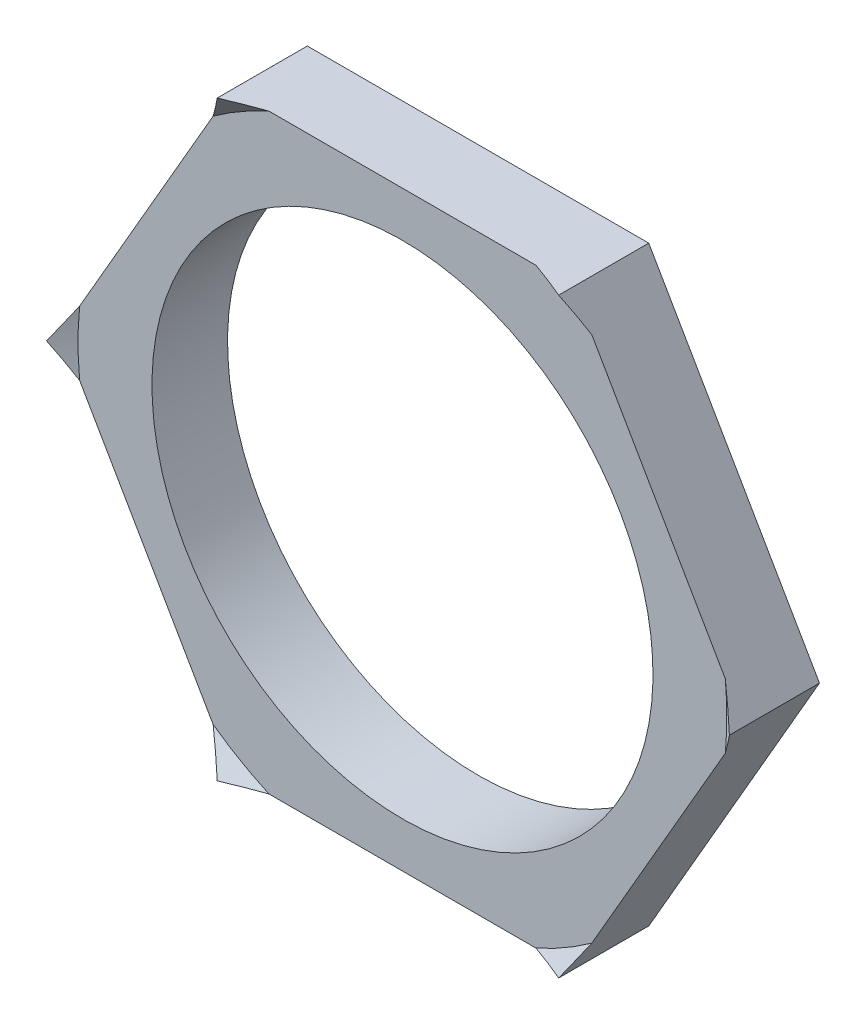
ISO-10303-21;
HEADER;
FILE_DESCRIPTION(('STEP AP214'),'2;1');
FILE_NAME('part.step','',(''),(''),'','','');
FILE_SCHEMA(('AUTOMOTIVE_DESIGN { 1 0 10303 214 1 1 1 1 }'));
ENDSEC;
DATA;
#1=APPLICATION_CONTEXT('core data for automotive mechanical design processes');
#2=APPLICATION_PROTOCOL_DEFINITION('international standard','automotive_design',2000,#1);
#3=PRODUCT_CONTEXT('',#1,'mechanical');
#4=PRODUCT('Part','Part','',(#3));
#5=PRODUCT_RELATED_PRODUCT_CATEGORY('part','',(#4));
#6=PRODUCT_DEFINITION_FORMATION('','',#4);
#7=PRODUCT_DEFINITION_CONTEXT('part definition',#1,'design');
#8=PRODUCT_DEFINITION('design','',#6,#7);
#9=PRODUCT_DEFINITION_SHAPE('','',#8);
#10=(LENGTH_UNIT() NAMED_UNIT(*) SI_UNIT(.MILLI.,.METRE.));
#11=(NAMED_UNIT(*) PLANE_ANGLE_UNIT() SI_UNIT($,.RADIAN.));
#12=(NAMED_UNIT(*) SI_UNIT($,.STERADIAN.) SOLID_ANGLE_UNIT());
#13=UNCERTAINTY_MEASURE_WITH_UNIT(LENGTH_MEASURE(1.E-05),#10,'distance_accuracy_value','');
#14=(GEOMETRIC_REPRESENTATION_CONTEXT(3) GLOBAL_UNCERTAINTY_ASSIGNED_CONTEXT((#13)) GLOBAL_UNIT_ASSIGNED_CONTEXT((#10,
#11,#12)) REPRESENTATION_CONTEXT('',''));
#15=CARTESIAN_POINT('',(0.,0.,0.));
#16=DIRECTION('',(0.,0.,1.));
#17=DIRECTION('',(1.,0.,0.));
#18=AXIS2_PLACEMENT_3D('',#15,#16,#17);
#19=CARTESIAN_POINT('',(0.,0.,-2.5));
#20=DIRECTION('',(0.,0.,1.));
#21=DIRECTION('',(0.5,0.866025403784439,0.));
#22=AXIS2_PLACEMENT_3D('',#19,#20,#21);
#23=CONICAL_SURFACE('',#22,19.75,0.863937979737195);
#24=CARTESIAN_POINT('',(0.,0.,-2.5));
#25=DIRECTION('',(0.,0.,1.));
#26=DIRECTION('',(0.5,0.866025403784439,0.));
#27=AXIS2_PLACEMENT_3D('',#24,#25,#26);
#28=CIRCLE('',#27,19.75);
#29=CARTESIAN_POINT('',(11.5245152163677,16.0389541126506,-2.5));
#30=VERTEX_POINT('',#29);
#31=CARTESIAN_POINT('',(8.12788410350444,18.,-2.5));
#32=VERTEX_POINT('',#31);
#33=EDGE_CURVE('E43',#30,#32,#28,.T.);
#34=ORIENTED_EDGE('',*,*,#33,.F.);
#35=CARTESIAN_POINT('',(11.5245152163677,16.0389541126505,-2.49999999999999));
#36=CARTESIAN_POINT('',(11.47782751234,16.1198194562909,-2.46717979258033));
#37=CARTESIAN_POINT('',(11.4312128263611,16.2005572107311,-2.43394201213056));
#38=CARTESIAN_POINT('',(11.3378416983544,16.3622773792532,-2.36644724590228));
#39=CARTESIAN_POINT('',(11.291086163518,16.4432582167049,-2.33218522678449));
#40=CARTESIAN_POINT('',(11.1974236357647,16.6054827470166,-2.26264213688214));
#41=CARTESIAN_POINT('',(11.1505175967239,16.6867247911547,-2.22735593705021));
#42=CARTESIAN_POINT('',(11.0565442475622,16.8494893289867,-2.15576456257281));
#43=CARTESIAN_POINT('',(11.0094779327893,16.931010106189,-2.11945417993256));
#44=CARTESIAN_POINT('',(10.9151743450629,17.0943490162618,-2.04581451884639));
#45=CARTESIAN_POINT('',(10.8679381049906,17.1761653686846,-2.00847996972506));
#46=CARTESIAN_POINT('',(10.7732850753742,17.340111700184,-1.93279202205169));
#47=CARTESIAN_POINT('',(10.7258693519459,17.4222398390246,-1.89443330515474));
#48=CARTESIAN_POINT('',(10.6308479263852,17.5868253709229,-1.81669710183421));
#49=CARTESIAN_POINT('',(10.5832433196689,17.6692808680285,-1.77731426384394));
#50=CARTESIAN_POINT('',(10.4878348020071,17.834536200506,-1.69752970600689));
#51=CARTESIAN_POINT('',(10.4400320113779,17.9173340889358,-1.65712261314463));
#52=CARTESIAN_POINT('',(10.3923048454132,18.0000000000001,-1.61635984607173));
#53=B_SPLINE_CURVE_WITH_KNOTS('',3,(#35,#36,#37,#38,#39,#40,#41,#42,#43,#44,#45,#46,#47,#48,#49,
#50,#51,#52),.UNSPECIFIED.,.F.,.F.,(4,2,2,2,2,2,2,2,4),(0.,0.296924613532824,0.595686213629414,
0.896365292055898,1.19903965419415,1.50378444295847,1.81067216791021,2.11977273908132,
2.43115350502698),.UNSPECIFIED.);
#54=CARTESIAN_POINT('',(10.3923048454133,18.,-1.61635984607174));
#55=VERTEX_POINT('',#54);
#56=EDGE_CURVE('E11',#30,#55,#53,.T.);
#57=ORIENTED_EDGE('',*,*,#56,.T.);
#58=CARTESIAN_POINT('',(10.3923048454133,18.,-1.61635984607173));
#59=CARTESIAN_POINT('',(10.2968504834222,17.999999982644,-1.65712261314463));
#60=CARTESIAN_POINT('',(10.2012440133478,17.9999994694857,-1.69752970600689));
#61=CARTESIAN_POINT('',(10.0104244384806,17.9999980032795,-1.77731426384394));
#62=CARTESIAN_POINT('',(9.91521357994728,17.9999970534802,-1.8166971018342));
#63=CARTESIAN_POINT('',(9.72516761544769,17.9999952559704,-1.89443330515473));
#64=CARTESIAN_POINT('',(9.63033469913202,17.9999944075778,-1.93279202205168));
#65=CARTESIAN_POINT('',(9.44102649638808,17.999993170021,-2.00847996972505));
#66=CARTESIAN_POINT('',(9.34655333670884,17.9999927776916,-2.04581451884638));
#67=CARTESIAN_POINT('',(9.15794589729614,17.9999926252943,-2.11945417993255));
#68=CARTESIAN_POINT('',(9.06381367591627,17.9999928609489,-2.1557645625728));
#69=CARTESIAN_POINT('',(8.87586877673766,17.9999938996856,-2.2273559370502));
#70=CARTESIAN_POINT('',(8.78205808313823,17.9999946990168,-2.26264213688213));
#71=CARTESIAN_POINT('',(8.59473625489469,17.999996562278,-2.33218522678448));
#72=CARTESIAN_POINT('',(8.50122702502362,17.999997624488,-2.36644724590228));
#73=CARTESIAN_POINT('',(8.3144876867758,17.9999993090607,-2.43394201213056));
#74=CARTESIAN_POINT('',(8.2212593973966,17.9999999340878,-2.46717979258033));
#75=CARTESIAN_POINT('',(8.12788410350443,18.,-2.49999999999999));
#76=B_SPLINE_CURVE_WITH_KNOTS('',3,(#58,#59,#60,#61,#62,#63,#64,#65,#66,#67,#68,#69,#70,#71,#72,
#73,#74,#75),.UNSPECIFIED.,.F.,.F.,(4,2,2,2,2,2,2,2,4),(0.,0.311380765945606,0.620481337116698,
0.927369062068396,1.2321138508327,1.53478821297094,1.83546729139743,2.13422889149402,
2.43115350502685),.UNSPECIFIED.);
#77=EDGE_CURVE('E30',#55,#32,#76,.T.);
#78=ORIENTED_EDGE('',*,*,#77,.T.);
#79=EDGE_LOOP('',(#34,#57,#78));
#80=FACE_BOUND('',#79,.T.);
#81=ADVANCED_FACE('F16',(#80),#23,.F.);
#82=CARTESIAN_POINT('',(0.,0.,-1.6));
#83=DIRECTION('',(0.,0.,-1.));
#84=DIRECTION('',(-0.5,-0.866025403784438,0.));
#85=AXIS2_PLACEMENT_3D('',#82,#83,#84);
#86=CYLINDRICAL_SURFACE('',#85,15.25);
#87=CARTESIAN_POINT('',(0.,0.,-2.5));
#88=DIRECTION('',(0.,0.,1.));
#89=DIRECTION('',(0.5,0.866025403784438,0.));
#90=AXIS2_PLACEMENT_3D('',#87,#88,#89);
#91=CIRCLE('',#90,15.25);
#92=CARTESIAN_POINT('',(7.625,13.2068874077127,-2.5));
#93=VERTEX_POINT('',#92);
#94=EDGE_CURVE('E372',#93,#93,#91,.T.);
#95=ORIENTED_EDGE('',*,*,#94,.T.);
#96=EDGE_LOOP('',(#95));
#97=FACE_BOUND('',#96,.T.);
#98=CARTESIAN_POINT('',(0.,0.,-7.1));
#99=DIRECTION('',(0.,0.,1.));
#100=DIRECTION('',(0.5,0.866025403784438,0.));
#101=AXIS2_PLACEMENT_3D('',#98,#99,#100);
#102=CIRCLE('',#101,15.25);
#103=CARTESIAN_POINT('',(-7.625,-13.2068874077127,-7.1));
#104=VERTEX_POINT('',#103);
#105=EDGE_CURVE('E807',#104,#104,#102,.T.);
#106=ORIENTED_EDGE('',*,*,#105,.F.);
#107=EDGE_LOOP('',(#106));
#108=FACE_BOUND('',#107,.T.);
#109=ADVANCED_FACE('F482',(#97,#108),#86,.F.);
#110=CARTESIAN_POINT('',(-10.3923048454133,18.,-1.6));
#111=DIRECTION('',(0.,-1.,0.));
#112=DIRECTION('',(0.,0.,-1.));
#113=AXIS2_PLACEMENT_3D('',#110,#111,#112);
#114=PLANE('',#113);
#115=ORIENTED_EDGE('',*,*,#77,.F.);
#116=DIRECTION('',(0.,0.,-1.));
#117=VECTOR('',#116,1.);
#118=CARTESIAN_POINT('',(10.3923048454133,18.,-1.6));
#119=LINE('',#118,#117);
#120=CARTESIAN_POINT('',(10.3923048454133,18.,-7.1));
#121=VERTEX_POINT('',#120);
#122=EDGE_CURVE('E368',#55,#121,#119,.T.);
#123=ORIENTED_EDGE('',*,*,#122,.T.);
#124=DIRECTION('',(-1.,0.,0.));
#125=VECTOR('',#124,1.);
#126=CARTESIAN_POINT('',(-10.3923048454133,18.,-7.1));
#127=LINE('',#126,#125);
#128=CARTESIAN_POINT('',(-10.3923048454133,18.,-7.1));
#129=VERTEX_POINT('',#128);
#130=EDGE_CURVE('E373',#121,#129,#127,.T.);
#131=ORIENTED_EDGE('',*,*,#130,.T.);
#132=DIRECTION('',(0.,0.,-1.));
#133=VECTOR('',#132,1.);
#134=CARTESIAN_POINT('',(-10.3923048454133,18.,-1.6));
#135=LINE('',#134,#133);
#136=CARTESIAN_POINT('',(-10.3923048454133,18.,-1.61635984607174));
#137=VERTEX_POINT('',#136);
#138=EDGE_CURVE('E432',#137,#129,#135,.T.);
#139=ORIENTED_EDGE('',*,*,#138,.F.);
#140=CARTESIAN_POINT('',(-8.12788410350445,18.,-2.49999999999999));
#141=CARTESIAN_POINT('',(-8.22125939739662,17.9999999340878,-2.46717979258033));
#142=CARTESIAN_POINT('',(-8.31448768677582,17.9999993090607,-2.43394201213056));
#143=CARTESIAN_POINT('',(-8.50122702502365,17.999997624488,-2.36644724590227));
#144=CARTESIAN_POINT('',(-8.59473625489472,17.9999965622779,-2.33218522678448));
#145=CARTESIAN_POINT('',(-8.78205808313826,17.9999946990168,-2.26264213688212));
#146=CARTESIAN_POINT('',(-8.87586877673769,17.9999938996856,-2.2273559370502));
#147=CARTESIAN_POINT('',(-9.0638136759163,17.9999928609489,-2.1557645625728));
#148=CARTESIAN_POINT('',(-9.15794589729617,17.9999926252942,-2.11945417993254));
#149=CARTESIAN_POINT('',(-9.34655333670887,17.9999927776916,-2.04581451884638));
#150=CARTESIAN_POINT('',(-9.44102649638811,17.999993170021,-2.00847996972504));
#151=CARTESIAN_POINT('',(-9.63033469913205,17.9999944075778,-1.93279202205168));
#152=CARTESIAN_POINT('',(-9.72516761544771,17.9999952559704,-1.89443330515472));
#153=CARTESIAN_POINT('',(-9.91521357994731,17.9999970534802,-1.8166971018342));
#154=CARTESIAN_POINT('',(-10.0104244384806,17.9999980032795,-1.77731426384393));
#155=CARTESIAN_POINT('',(-10.2012440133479,17.9999994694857,-1.69752970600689));
#156=CARTESIAN_POINT('',(-10.2968504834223,17.9999999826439,-1.65712261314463));
#157=CARTESIAN_POINT('',(-10.3923048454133,18.,-1.61635984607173));
#158=B_SPLINE_CURVE_WITH_KNOTS('',3,(#140,#141,#142,#143,#144,#145,#146,#147,#148,#149,#150,
#151,#152,#153,#154,#155,#156,#157),.UNSPECIFIED.,.F.,.F.,(4,2,2,2,2,2,2,2,4),(0.,
0.296924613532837,0.595686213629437,0.896365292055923,1.19903965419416,1.50378444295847,
1.81067216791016,2.11977273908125,2.43115350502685),.UNSPECIFIED.);
#159=CARTESIAN_POINT('',(-8.12788410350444,18.,-2.5));
#160=VERTEX_POINT('',#159);
#161=EDGE_CURVE('E407',#160,#137,#158,.T.);
#162=ORIENTED_EDGE('',*,*,#161,.F.);
#163=DIRECTION('',(-1.,0.,0.));
#164=VECTOR('',#163,1.);
#165=CARTESIAN_POINT('',(-10.3923048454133,18.,-2.5));
#166=LINE('',#165,#164);
#167=EDGE_CURVE('E391',#32,#160,#166,.T.);
#168=ORIENTED_EDGE('',*,*,#167,.F.);
#169=EDGE_LOOP('',(#115,#123,#131,#139,#162,#168));
#170=FACE_BOUND('',#169,.T.);
#171=ADVANCED_FACE('F177',(#170),#114,.F.);
#172=CARTESIAN_POINT('',(-10.3923048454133,18.,-1.6));
#173=DIRECTION('',(0.866025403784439,-0.5,0.));
#174=DIRECTION('',(0.5,0.866025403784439,0.));
#175=AXIS2_PLACEMENT_3D('',#172,#173,#174);
#176=PLANE('',#175);
#177=CARTESIAN_POINT('',(-10.3923048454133,18.,-1.61635984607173));
#178=CARTESIAN_POINT('',(-10.440032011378,17.9173340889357,-1.65712261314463));
#179=CARTESIAN_POINT('',(-10.4878348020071,17.834536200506,-1.69752970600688));
#180=CARTESIAN_POINT('',(-10.5832433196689,17.6692808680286,-1.77731426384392));
#181=CARTESIAN_POINT('',(-10.6308479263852,17.5868253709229,-1.81669710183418));
#182=CARTESIAN_POINT('',(-10.7258693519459,17.4222398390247,-1.8944333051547));
#183=CARTESIAN_POINT('',(-10.7732850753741,17.3401117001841,-1.93279202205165));
#184=CARTESIAN_POINT('',(-10.8679381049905,17.1761653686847,-2.00847996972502));
#185=CARTESIAN_POINT('',(-10.9151743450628,17.0943490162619,-2.04581451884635));
#186=CARTESIAN_POINT('',(-11.0094779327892,16.9310101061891,-2.11945417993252));
#187=CARTESIAN_POINT('',(-11.0565442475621,16.8494893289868,-2.15576456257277));
#188=CARTESIAN_POINT('',(-11.1505175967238,16.6867247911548,-2.22735593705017));
#189=CARTESIAN_POINT('',(-11.1974236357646,16.6054827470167,-2.2626421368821));
#190=CARTESIAN_POINT('',(-11.2910861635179,16.443258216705,-2.33218522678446));
#191=CARTESIAN_POINT('',(-11.3378416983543,16.3622773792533,-2.36644724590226));
#192=CARTESIAN_POINT('',(-11.431212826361,16.2005572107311,-2.43394201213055));
#193=CARTESIAN_POINT('',(-11.4778275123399,16.1198194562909,-2.46717979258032));
#194=CARTESIAN_POINT('',(-11.5245152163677,16.0389541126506,-2.49999999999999));
#195=B_SPLINE_CURVE_WITH_KNOTS('',3,(#177,#178,#179,#180,#181,#182,#183,#184,#185,#186,#187,
#188,#189,#190,#191,#192,#193,#194),.UNSPECIFIED.,.F.,.F.,(4,2,2,2,2,2,2,2,4),(0.,
0.311380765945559,0.620481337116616,0.927369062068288,1.23211385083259,1.53478821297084,
1.83546729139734,2.13422889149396,2.43115350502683),.UNSPECIFIED.);
#196=CARTESIAN_POINT('',(-11.5245152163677,16.0389541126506,-2.5));
#197=VERTEX_POINT('',#196);
#198=EDGE_CURVE('E440',#137,#197,#195,.T.);
#199=ORIENTED_EDGE('',*,*,#198,.F.);
#200=ORIENTED_EDGE('',*,*,#138,.T.);
#201=DIRECTION('',(-0.5,-0.866025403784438,0.));
#202=VECTOR('',#201,1.);
#203=CARTESIAN_POINT('',(-10.3923048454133,18.,-7.1));
#204=LINE('',#203,#202);
#205=CARTESIAN_POINT('',(-20.7846096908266,0.,-7.1));
#206=VERTEX_POINT('',#205);
#207=EDGE_CURVE('E435',#129,#206,#204,.T.);
#208=ORIENTED_EDGE('',*,*,#207,.T.);
#209=DIRECTION('',(0.,0.,-1.));
#210=VECTOR('',#209,1.);
#211=CARTESIAN_POINT('',(-20.7846096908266,0.,-1.6));
#212=LINE('',#211,#210);
#213=CARTESIAN_POINT('',(-20.7846096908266,0.,-1.61635984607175));
#214=VERTEX_POINT('',#213);
#215=EDGE_CURVE('E505',#214,#206,#212,.T.);
#216=ORIENTED_EDGE('',*,*,#215,.F.);
#217=CARTESIAN_POINT('',(-19.6523993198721,1.96104588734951,-2.49999999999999));
#218=CARTESIAN_POINT('',(-19.6990869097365,1.88018047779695,-2.46717979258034));
#219=CARTESIAN_POINT('',(-19.7457005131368,1.79944209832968,-2.43394201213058));
#220=CARTESIAN_POINT('',(-19.8390687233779,1.63772024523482,-2.36644724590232));
#221=CARTESIAN_POINT('',(-19.8858224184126,1.55673834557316,-2.33218522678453));
#222=CARTESIAN_POINT('',(-19.9794817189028,1.39451195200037,-2.26264213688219));
#223=CARTESIAN_POINT('',(-20.0263863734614,1.31326910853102,-2.22735593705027));
#224=CARTESIAN_POINT('',(-20.1203579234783,1.15050353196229,-2.15576456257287));
#225=CARTESIAN_POINT('',(-20.1674238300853,1.06898251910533,-2.11945417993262));
#226=CARTESIAN_POINT('',(-20.2617276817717,0.905643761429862,-2.04581451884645));
#227=CARTESIAN_POINT('',(-20.3089646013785,0.823827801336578,-2.00847996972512));
#228=CARTESIAN_POINT('',(-20.4036197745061,0.659882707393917,-1.93279202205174));
#229=CARTESIAN_POINT('',(-20.4510369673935,0.577755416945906,-1.89443330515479));
#230=CARTESIAN_POINT('',(-20.5460615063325,0.413171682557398,-1.81669710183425));
#231=CARTESIAN_POINT('',(-20.5936677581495,0.330717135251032,-1.77731426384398));
#232=CARTESIAN_POINT('',(-20.689078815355,0.165463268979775,-1.69752970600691));
#233=CARTESIAN_POINT('',(-20.7368824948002,0.0826658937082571,-1.65712261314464));
#234=CARTESIAN_POINT('',(-20.7846096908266,0.,-1.61635984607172));
#235=B_SPLINE_CURVE_WITH_KNOTS('',3,(#217,#218,#219,#220,#221,#222,#223,#224,#225,#226,#227,
#228,#229,#230,#231,#232,#233,#234),.UNSPECIFIED.,.F.,.F.,(4,2,2,2,2,2,2,2,4),(0.,
0.296924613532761,0.595686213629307,0.896365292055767,1.199039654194,1.50378444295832,
1.81067216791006,2.1197727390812,2.43115350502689),.UNSPECIFIED.);
#236=CARTESIAN_POINT('',(-19.6523993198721,1.96104588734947,-2.5));
#237=VERTEX_POINT('',#236);
#238=EDGE_CURVE('E469',#237,#214,#235,.T.);
#239=ORIENTED_EDGE('',*,*,#238,.F.);
#240=DIRECTION('',(-0.5,-0.866025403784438,0.));
#241=VECTOR('',#240,1.);
#242=CARTESIAN_POINT('',(-10.3923048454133,18.,-2.5));
#243=LINE('',#242,#241);
#244=EDGE_CURVE('E429',#197,#237,#243,.T.);
#245=ORIENTED_EDGE('',*,*,#244,.F.);
#246=EDGE_LOOP('',(#199,#200,#208,#216,#239,#245));
#247=FACE_BOUND('',#246,.T.);
#248=ADVANCED_FACE('F18',(#247),#176,.F.);
#249=CARTESIAN_POINT('',(-20.7846096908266,0.,-1.6));
#250=DIRECTION('',(0.866025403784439,0.5,0.));
#251=DIRECTION('',(0.5,-0.866025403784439,0.));
#252=AXIS2_PLACEMENT_3D('',#249,#250,#251);
#253=PLANE('',#252);
#254=CARTESIAN_POINT('',(-20.7846096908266,0.,-1.61635984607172));
#255=CARTESIAN_POINT('',(-20.7368824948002,-0.0826658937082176,-1.65712261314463));
#256=CARTESIAN_POINT('',(-20.689078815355,-0.165463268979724,-1.69752970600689));
#257=CARTESIAN_POINT('',(-20.5936677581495,-0.33071713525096,-1.77731426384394));
#258=CARTESIAN_POINT('',(-20.5460615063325,-0.413171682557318,-1.81669710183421));
#259=CARTESIAN_POINT('',(-20.4510369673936,-0.577755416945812,-1.89443330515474));
#260=CARTESIAN_POINT('',(-20.4036197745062,-0.659882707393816,-1.93279202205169));
#261=CARTESIAN_POINT('',(-20.3089646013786,-0.823827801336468,-2.00847996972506));
#262=CARTESIAN_POINT('',(-20.2617276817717,-0.90564376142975,-2.0458145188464));
#263=CARTESIAN_POINT('',(-20.1674238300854,-1.06898251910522,-2.11945417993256));
#264=CARTESIAN_POINT('',(-20.1203579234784,-1.15050353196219,-2.15576456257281));
#265=CARTESIAN_POINT('',(-20.0263863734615,-1.31326910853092,-2.22735593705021));
#266=CARTESIAN_POINT('',(-19.9794817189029,-1.39451195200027,-2.26264213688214));
#267=CARTESIAN_POINT('',(-19.8858224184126,-1.55673834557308,-2.33218522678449));
#268=CARTESIAN_POINT('',(-19.8390687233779,-1.63772024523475,-2.36644724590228));
#269=CARTESIAN_POINT('',(-19.7457005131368,-1.79944209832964,-2.43394201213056));
#270=CARTESIAN_POINT('',(-19.6990869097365,-1.88018047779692,-2.46717979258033));
#271=CARTESIAN_POINT('',(-19.6523993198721,-1.96104588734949,-2.49999999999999));
#272=B_SPLINE_CURVE_WITH_KNOTS('',3,(#254,#255,#256,#257,#258,#259,#260,#261,#262,#263,#264,
#265,#266,#267,#268,#269,#270,#271),.UNSPECIFIED.,.F.,.F.,(4,2,2,2,2,2,2,2,4),(0.,
0.311380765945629,0.620481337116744,0.927369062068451,1.23211385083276,1.53478821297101,
1.83546729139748,2.13422889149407,2.43115350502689),.UNSPECIFIED.);
#273=CARTESIAN_POINT('',(-19.6523993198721,-1.96104588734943,-2.5));
#274=VERTEX_POINT('',#273);
#275=EDGE_CURVE('E496',#214,#274,#272,.T.);
#276=ORIENTED_EDGE('',*,*,#275,.F.);
#277=ORIENTED_EDGE('',*,*,#215,.T.);
#278=DIRECTION('',(-0.5,0.866025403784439,0.));
#279=VECTOR('',#278,1.);
#280=CARTESIAN_POINT('',(-20.7846096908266,0.,-7.1));
#281=LINE('',#280,#279);
#282=CARTESIAN_POINT('',(-10.3923048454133,-18.,-7.1));
#283=VERTEX_POINT('',#282);
#284=EDGE_CURVE('E135',#283,#206,#281,.T.);
#285=ORIENTED_EDGE('',*,*,#284,.F.);
#286=DIRECTION('',(0.,0.,-1.));
#287=VECTOR('',#286,1.);
#288=CARTESIAN_POINT('',(-10.3923048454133,-18.,-1.6));
#289=LINE('',#288,#287);
#290=CARTESIAN_POINT('',(-10.3923048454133,-18.,-1.61635984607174));
#291=VERTEX_POINT('',#290);
#292=EDGE_CURVE('E131',#291,#283,#289,.T.);
#293=ORIENTED_EDGE('',*,*,#292,.F.);
#294=CARTESIAN_POINT('',(-11.5245152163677,-16.0389541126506,-2.49999999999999));
#295=CARTESIAN_POINT('',(-11.4778275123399,-16.1198194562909,-2.46717979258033));
#296=CARTESIAN_POINT('',(-11.431212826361,-16.2005572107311,-2.43394201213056));
#297=CARTESIAN_POINT('',(-11.3378416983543,-16.3622773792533,-2.36644724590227));
#298=CARTESIAN_POINT('',(-11.2910861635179,-16.4432582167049,-2.33218522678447));
#299=CARTESIAN_POINT('',(-11.1974236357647,-16.6054827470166,-2.26264213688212));
#300=CARTESIAN_POINT('',(-11.1505175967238,-16.6867247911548,-2.22735593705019));
#301=CARTESIAN_POINT('',(-11.0565442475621,-16.8494893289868,-2.15576456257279));
#302=CARTESIAN_POINT('',(-11.0094779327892,-16.9310101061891,-2.11945417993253));
#303=CARTESIAN_POINT('',(-10.9151743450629,-17.0943490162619,-2.04581451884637));
#304=CARTESIAN_POINT('',(-10.8679381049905,-17.1761653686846,-2.00847996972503));
#305=CARTESIAN_POINT('',(-10.7732850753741,-17.340111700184,-1.93279202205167));
#306=CARTESIAN_POINT('',(-10.7258693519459,-17.4222398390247,-1.89443330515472));
#307=CARTESIAN_POINT('',(-10.6308479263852,-17.5868253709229,-1.8166971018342));
#308=CARTESIAN_POINT('',(-10.5832433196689,-17.6692808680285,-1.77731426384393));
#309=CARTESIAN_POINT('',(-10.4878348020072,-17.834536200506,-1.69752970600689));
#310=CARTESIAN_POINT('',(-10.440032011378,-17.9173340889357,-1.65712261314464));
#311=CARTESIAN_POINT('',(-10.3923048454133,-18.,-1.61635984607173));
#312=B_SPLINE_CURVE_WITH_KNOTS('',3,(#294,#295,#296,#297,#298,#299,#300,#301,#302,#303,#304,
#305,#306,#307,#308,#309,#310,#311),.UNSPECIFIED.,.F.,.F.,(4,2,2,2,2,2,2,2,4),(0.,
0.296924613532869,0.595686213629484,0.896365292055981,1.19903965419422,1.50378444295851,
1.81067216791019,2.11977273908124,2.4311535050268),.UNSPECIFIED.);
#313=CARTESIAN_POINT('',(-11.5245152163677,-16.0389541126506,-2.5));
#314=VERTEX_POINT('',#313);
#315=EDGE_CURVE('E114',#314,#291,#312,.T.);
#316=ORIENTED_EDGE('',*,*,#315,.F.);
#317=DIRECTION('',(0.5,-0.866025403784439,0.));
#318=VECTOR('',#317,1.);
#319=CARTESIAN_POINT('',(-20.7846096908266,0.,-2.5));
#320=LINE('',#319,#318);
#321=EDGE_CURVE('E199',#274,#314,#320,.T.);
#322=ORIENTED_EDGE('',*,*,#321,.F.);
#323=EDGE_LOOP('',(#276,#277,#285,#293,#316,#322));
#324=FACE_BOUND('',#323,.T.);
#325=ADVANCED_FACE('F133',(#324),#253,.F.);
#326=CARTESIAN_POINT('',(20.7846096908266,0.,-1.6));
#327=DIRECTION('',(-0.866025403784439,-0.5,0.));
#328=DIRECTION('',(0.,0.,1.));
#329=AXIS2_PLACEMENT_3D('',#326,#327,#328);
#330=PLANE('',#329);
#331=CARTESIAN_POINT('',(20.7846096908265,0.,-1.61635984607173));
#332=CARTESIAN_POINT('',(20.7368824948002,0.0826658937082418,-1.65712261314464));
#333=CARTESIAN_POINT('',(20.689078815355,0.165463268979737,-1.6975297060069));
#334=CARTESIAN_POINT('',(20.5936677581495,0.330717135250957,-1.77731426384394));
#335=CARTESIAN_POINT('',(20.5460615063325,0.41317168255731,-1.81669710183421));
#336=CARTESIAN_POINT('',(20.4510369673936,0.577755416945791,-1.89443330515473));
#337=CARTESIAN_POINT('',(20.4036197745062,0.659882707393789,-1.93279202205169));
#338=CARTESIAN_POINT('',(20.3089646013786,0.823827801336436,-2.00847996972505));
#339=CARTESIAN_POINT('',(20.2617276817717,0.905643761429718,-2.04581451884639));
#340=CARTESIAN_POINT('',(20.1674238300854,1.06898251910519,-2.11945417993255));
#341=CARTESIAN_POINT('',(20.1203579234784,1.15050353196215,-2.1557645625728));
#342=CARTESIAN_POINT('',(20.0263863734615,1.31326910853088,-2.2273559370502));
#343=CARTESIAN_POINT('',(19.9794817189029,1.39451195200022,-2.26264213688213));
#344=CARTESIAN_POINT('',(19.8858224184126,1.55673834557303,-2.33218522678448));
#345=CARTESIAN_POINT('',(19.8390687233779,1.6377202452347,-2.36644724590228));
#346=CARTESIAN_POINT('',(19.7457005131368,1.79944209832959,-2.43394201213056));
#347=CARTESIAN_POINT('',(19.6990869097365,1.88018047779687,-2.46717979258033));
#348=CARTESIAN_POINT('',(19.6523993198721,1.96104588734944,-2.49999999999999));
#349=B_SPLINE_CURVE_WITH_KNOTS('',3,(#331,#332,#333,#334,#335,#336,#337,#338,#339,#340,#341,
#342,#343,#344,#345,#346,#347,#348),.UNSPECIFIED.,.F.,.F.,(4,2,2,2,2,2,2,2,4),(0.,
0.311380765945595,0.620481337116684,0.927369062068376,1.23211385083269,1.53478821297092,
1.83546729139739,2.13422889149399,2.43115350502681),.UNSPECIFIED.);
#350=CARTESIAN_POINT('',(20.7846096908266,0.,-1.61635984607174));
#351=VERTEX_POINT('',#350);
#352=CARTESIAN_POINT('',(19.6523993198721,1.96104588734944,-2.5));
#353=VERTEX_POINT('',#352);
#354=EDGE_CURVE('E330',#351,#353,#349,.T.);
#355=ORIENTED_EDGE('',*,*,#354,.F.);
#356=DIRECTION('',(0.,0.,-1.));
#357=VECTOR('',#356,1.);
#358=CARTESIAN_POINT('',(20.7846096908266,0.,-1.6));
#359=LINE('',#358,#357);
#360=CARTESIAN_POINT('',(20.7846096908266,0.,-7.1));
#361=VERTEX_POINT('',#360);
#362=EDGE_CURVE('E334',#351,#361,#359,.T.);
#363=ORIENTED_EDGE('',*,*,#362,.T.);
#364=DIRECTION('',(0.5,-0.866025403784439,0.));
#365=VECTOR('',#364,1.);
#366=CARTESIAN_POINT('',(20.7846096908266,0.,-7.1));
#367=LINE('',#366,#365);
#368=EDGE_CURVE('E854',#121,#361,#367,.T.);
#369=ORIENTED_EDGE('',*,*,#368,.F.);
#370=ORIENTED_EDGE('',*,*,#122,.F.);
#371=ORIENTED_EDGE('',*,*,#56,.F.);
#372=DIRECTION('',(-0.5,0.866025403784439,0.));
#373=VECTOR('',#372,1.);
#374=CARTESIAN_POINT('',(20.7846096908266,0.,-2.5));
#375=LINE('',#374,#373);
#376=EDGE_CURVE('E361',#353,#30,#375,.T.);
#377=ORIENTED_EDGE('',*,*,#376,.F.);
#378=EDGE_LOOP('',(#355,#363,#369,#370,#371,#377));
#379=FACE_BOUND('',#378,.T.);
#380=ADVANCED_FACE('F276',(#379),#330,.F.);
#381=CARTESIAN_POINT('',(20.7846096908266,0.,-1.6));
#382=DIRECTION('',(-0.866025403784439,0.5,0.));
#383=DIRECTION('',(0.,0.,1.));
#384=AXIS2_PLACEMENT_3D('',#381,#382,#383);
#385=PLANE('',#384);
#386=CARTESIAN_POINT('',(10.3923048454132,-18.,-1.61635984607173));
#387=CARTESIAN_POINT('',(10.440032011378,-17.9173340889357,-1.65712261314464));
#388=CARTESIAN_POINT('',(10.4878348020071,-17.834536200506,-1.69752970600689));
#389=CARTESIAN_POINT('',(10.5832433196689,-17.6692808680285,-1.77731426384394));
#390=CARTESIAN_POINT('',(10.6308479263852,-17.5868253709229,-1.8166971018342));
#391=CARTESIAN_POINT('',(10.7258693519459,-17.4222398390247,-1.89443330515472));
#392=CARTESIAN_POINT('',(10.7732850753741,-17.340111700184,-1.93279202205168));
#393=CARTESIAN_POINT('',(10.8679381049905,-17.1761653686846,-2.00847996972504));
#394=CARTESIAN_POINT('',(10.9151743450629,-17.0943490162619,-2.04581451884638));
#395=CARTESIAN_POINT('',(11.0094779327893,-16.9310101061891,-2.11945417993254));
#396=CARTESIAN_POINT('',(11.0565442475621,-16.8494893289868,-2.1557645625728));
#397=CARTESIAN_POINT('',(11.1505175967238,-16.6867247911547,-2.2273559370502));
#398=CARTESIAN_POINT('',(11.1974236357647,-16.6054827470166,-2.26264213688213));
#399=CARTESIAN_POINT('',(11.2910861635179,-16.4432582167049,-2.33218522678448));
#400=CARTESIAN_POINT('',(11.3378416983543,-16.3622773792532,-2.36644724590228));
#401=CARTESIAN_POINT('',(11.431212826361,-16.2005572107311,-2.43394201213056));
#402=CARTESIAN_POINT('',(11.4778275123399,-16.1198194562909,-2.46717979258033));
#403=CARTESIAN_POINT('',(11.5245152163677,-16.0389541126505,-2.5));
#404=B_SPLINE_CURVE_WITH_KNOTS('',3,(#386,#387,#388,#389,#390,#391,#392,#393,#394,#395,#396,
#397,#398,#399,#400,#401,#402,#403),.UNSPECIFIED.,.F.,.F.,(4,2,2,2,2,2,2,2,4),(0.,
0.311380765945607,0.620481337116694,0.927369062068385,1.23211385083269,1.53478821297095,
1.83546729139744,2.13422889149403,2.43115350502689),.UNSPECIFIED.);
#405=CARTESIAN_POINT('',(10.3923048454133,-18.,-1.61635984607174));
#406=VERTEX_POINT('',#405);
#407=CARTESIAN_POINT('',(11.5245152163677,-16.0389541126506,-2.5));
#408=VERTEX_POINT('',#407);
#409=EDGE_CURVE('E149',#406,#408,#404,.T.);
#410=ORIENTED_EDGE('',*,*,#409,.F.);
#411=DIRECTION('',(0.,0.,-1.));
#412=VECTOR('',#411,1.);
#413=CARTESIAN_POINT('',(10.3923048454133,-18.,-1.6));
#414=LINE('',#413,#412);
#415=CARTESIAN_POINT('',(10.3923048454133,-18.,-7.1));
#416=VERTEX_POINT('',#415);
#417=EDGE_CURVE('E140',#406,#416,#414,.T.);
#418=ORIENTED_EDGE('',*,*,#417,.T.);
#419=DIRECTION('',(-0.5,-0.866025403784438,0.));
#420=VECTOR('',#419,1.);
#421=CARTESIAN_POINT('',(20.7846096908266,0.,-7.1));
#422=LINE('',#421,#420);
#423=EDGE_CURVE('E838',#361,#416,#422,.T.);
#424=ORIENTED_EDGE('',*,*,#423,.F.);
#425=ORIENTED_EDGE('',*,*,#362,.F.);
#426=CARTESIAN_POINT('',(19.6523993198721,-1.96104588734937,-2.5));
#427=CARTESIAN_POINT('',(19.6990869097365,-1.88018047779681,-2.46717979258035));
#428=CARTESIAN_POINT('',(19.7457005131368,-1.79944209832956,-2.4339420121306));
#429=CARTESIAN_POINT('',(19.8390687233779,-1.63772024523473,-2.36644724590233));
#430=CARTESIAN_POINT('',(19.8858224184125,-1.55673834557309,-2.33218522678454));
#431=CARTESIAN_POINT('',(19.9794817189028,-1.39451195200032,-2.2626421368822));
#432=CARTESIAN_POINT('',(20.0263863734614,-1.31326910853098,-2.22735593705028));
#433=CARTESIAN_POINT('',(20.1203579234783,-1.15050353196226,-2.15576456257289));
#434=CARTESIAN_POINT('',(20.1674238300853,-1.06898251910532,-2.11945417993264));
#435=CARTESIAN_POINT('',(20.2617276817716,-0.905643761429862,-2.04581451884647));
#436=CARTESIAN_POINT('',(20.3089646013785,-0.823827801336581,-2.00847996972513));
#437=CARTESIAN_POINT('',(20.4036197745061,-0.659882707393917,-1.93279202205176));
#438=CARTESIAN_POINT('',(20.4510369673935,-0.577755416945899,-1.8944333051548));
#439=CARTESIAN_POINT('',(20.5460615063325,-0.413171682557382,-1.81669710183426));
#440=CARTESIAN_POINT('',(20.5936677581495,-0.330717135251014,-1.77731426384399));
#441=CARTESIAN_POINT('',(20.689078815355,-0.16546326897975,-1.69752970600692));
#442=CARTESIAN_POINT('',(20.7368824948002,-0.0826658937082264,-1.65712261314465));
#443=CARTESIAN_POINT('',(20.7846096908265,0.,-1.61635984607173));
#444=B_SPLINE_CURVE_WITH_KNOTS('',3,(#426,#427,#428,#429,#430,#431,#432,#433,#434,#435,#436,
#437,#438,#439,#440,#441,#442,#443),.UNSPECIFIED.,.F.,.F.,(4,2,2,2,2,2,2,2,4),(0.,
0.296924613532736,0.595686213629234,0.896365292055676,1.19903965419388,1.50378444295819,
1.81067216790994,2.1197727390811,2.4311535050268),.UNSPECIFIED.);
#445=CARTESIAN_POINT('',(19.6523993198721,-1.96104588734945,-2.5));
#446=VERTEX_POINT('',#445);
#447=EDGE_CURVE('E127',#446,#351,#444,.T.);
#448=ORIENTED_EDGE('',*,*,#447,.F.);
#449=DIRECTION('',(0.5,0.866025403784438,0.));
#450=VECTOR('',#449,1.);
#451=CARTESIAN_POINT('',(20.7846096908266,0.,-2.5));
#452=LINE('',#451,#450);
#453=EDGE_CURVE('E217',#408,#446,#452,.T.);
#454=ORIENTED_EDGE('',*,*,#453,.F.);
#455=EDGE_LOOP('',(#410,#418,#424,#425,#448,#454));
#456=FACE_BOUND('',#455,.T.);
#457=ADVANCED_FACE('F168',(#456),#385,.F.);
#458=CARTESIAN_POINT('',(10.3923048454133,-18.,-1.6));
#459=DIRECTION('',(0.,1.,0.));
#460=DIRECTION('',(0.,0.,-1.));
#461=AXIS2_PLACEMENT_3D('',#458,#459,#460);
#462=PLANE('',#461);
#463=CARTESIAN_POINT('',(-10.3923048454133,-18.,-1.61635984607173));
#464=CARTESIAN_POINT('',(-10.2968504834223,-17.9999999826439,-1.65712261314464));
#465=CARTESIAN_POINT('',(-10.2012440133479,-17.9999994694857,-1.6975297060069));
#466=CARTESIAN_POINT('',(-10.0104244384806,-17.9999980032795,-1.77731426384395));
#467=CARTESIAN_POINT('',(-9.91521357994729,-17.9999970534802,-1.81669710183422));
#468=CARTESIAN_POINT('',(-9.72516761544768,-17.9999952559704,-1.89443330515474));
#469=CARTESIAN_POINT('',(-9.63033469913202,-17.9999944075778,-1.9327920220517));
#470=CARTESIAN_POINT('',(-9.44102649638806,-17.999993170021,-2.00847996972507));
#471=CARTESIAN_POINT('',(-9.34655333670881,-17.9999927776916,-2.0458145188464));
#472=CARTESIAN_POINT('',(-9.15794589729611,-17.9999926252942,-2.11945417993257));
#473=CARTESIAN_POINT('',(-9.06381367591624,-17.9999928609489,-2.15576456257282));
#474=CARTESIAN_POINT('',(-8.87586877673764,-17.9999938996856,-2.22735593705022));
#475=CARTESIAN_POINT('',(-8.78205808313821,-17.9999946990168,-2.26264213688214));
#476=CARTESIAN_POINT('',(-8.59473625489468,-17.9999965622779,-2.33218522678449));
#477=CARTESIAN_POINT('',(-8.50122702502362,-17.9999976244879,-2.36644724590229));
#478=CARTESIAN_POINT('',(-8.31448768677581,-17.9999993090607,-2.43394201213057));
#479=CARTESIAN_POINT('',(-8.22125939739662,-17.9999999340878,-2.46717979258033));
#480=CARTESIAN_POINT('',(-8.12788410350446,-18.,-2.49999999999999));
#481=B_SPLINE_CURVE_WITH_KNOTS('',3,(#463,#464,#465,#466,#467,#468,#469,#470,#471,#472,#473,
#474,#475,#476,#477,#478,#479,#480),.UNSPECIFIED.,.F.,.F.,(4,2,2,2,2,2,2,2,4),(0.,
0.311380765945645,0.620481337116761,0.927369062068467,1.23211385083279,1.53478821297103,
1.8354672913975,2.13422889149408,2.43115350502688),.UNSPECIFIED.);
#482=CARTESIAN_POINT('',(-8.12788410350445,-18.,-2.5));
#483=VERTEX_POINT('',#482);
#484=EDGE_CURVE('E119',#291,#483,#481,.T.);
#485=ORIENTED_EDGE('',*,*,#484,.F.);
#486=ORIENTED_EDGE('',*,*,#292,.T.);
#487=DIRECTION('',(1.,0.,0.));
#488=VECTOR('',#487,1.);
#489=CARTESIAN_POINT('',(10.3923048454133,-18.,-7.1));
#490=LINE('',#489,#488);
#491=EDGE_CURVE('E141',#283,#416,#490,.T.);
#492=ORIENTED_EDGE('',*,*,#491,.T.);
#493=ORIENTED_EDGE('',*,*,#417,.F.);
#494=CARTESIAN_POINT('',(8.12788410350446,-18.,-2.5));
#495=CARTESIAN_POINT('',(8.22125939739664,-17.9999999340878,-2.46717979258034));
#496=CARTESIAN_POINT('',(8.31448768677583,-17.9999993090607,-2.43394201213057));
#497=CARTESIAN_POINT('',(8.50122702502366,-17.9999976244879,-2.36644724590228));
#498=CARTESIAN_POINT('',(8.59473625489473,-17.9999965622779,-2.33218522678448));
#499=CARTESIAN_POINT('',(8.78205808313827,-17.9999946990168,-2.26264213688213));
#500=CARTESIAN_POINT('',(8.8758687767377,-17.9999938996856,-2.2273559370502));
#501=CARTESIAN_POINT('',(9.06381367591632,-17.9999928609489,-2.1557645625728));
#502=CARTESIAN_POINT('',(9.15794589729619,-17.9999926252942,-2.11945417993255));
#503=CARTESIAN_POINT('',(9.34655333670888,-17.9999927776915,-2.04581451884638));
#504=CARTESIAN_POINT('',(9.44102649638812,-17.999993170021,-2.00847996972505));
#505=CARTESIAN_POINT('',(9.63033469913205,-17.9999944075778,-1.93279202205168));
#506=CARTESIAN_POINT('',(9.72516761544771,-17.9999952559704,-1.89443330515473));
#507=CARTESIAN_POINT('',(9.9152135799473,-17.9999970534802,-1.8166971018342));
#508=CARTESIAN_POINT('',(10.0104244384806,-17.9999980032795,-1.77731426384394));
#509=CARTESIAN_POINT('',(10.2012440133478,-17.9999994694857,-1.69752970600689));
#510=CARTESIAN_POINT('',(10.2968504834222,-17.9999999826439,-1.65712261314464));
#511=CARTESIAN_POINT('',(10.3923048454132,-18.,-1.61635984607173));
#512=B_SPLINE_CURVE_WITH_KNOTS('',3,(#494,#495,#496,#497,#498,#499,#500,#501,#502,#503,#504,
#505,#506,#507,#508,#509,#510,#511),.UNSPECIFIED.,.F.,.F.,(4,2,2,2,2,2,2,2,4),(0.,
0.296924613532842,0.595686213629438,0.896365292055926,1.19903965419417,1.50378444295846,
1.81067216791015,2.11977273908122,2.4311535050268),.UNSPECIFIED.);
#513=CARTESIAN_POINT('',(8.12788410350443,-18.,-2.5));
#514=VERTEX_POINT('',#513);
#515=EDGE_CURVE('E239',#514,#406,#512,.T.);
#516=ORIENTED_EDGE('',*,*,#515,.F.);
#517=DIRECTION('',(1.,0.,0.));
#518=VECTOR('',#517,1.);
#519=CARTESIAN_POINT('',(10.3923048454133,-18.,-2.5));
#520=LINE('',#519,#518);
#521=EDGE_CURVE('E147',#483,#514,#520,.T.);
#522=ORIENTED_EDGE('',*,*,#521,.F.);
#523=EDGE_LOOP('',(#485,#486,#492,#493,#516,#522));
#524=FACE_BOUND('',#523,.T.);
#525=ADVANCED_FACE('F144',(#524),#462,.F.);
#526=CARTESIAN_POINT('',(0.,0.,-7.1));
#527=DIRECTION('',(0.,0.,-1.));
#528=DIRECTION('',(-0.5,-0.866025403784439,0.));
#529=AXIS2_PLACEMENT_3D('',#526,#527,#528);
#530=PLANE('',#529);
#531=ORIENTED_EDGE('',*,*,#130,.F.);
#532=ORIENTED_EDGE('',*,*,#368,.T.);
#533=ORIENTED_EDGE('',*,*,#423,.T.);
#534=ORIENTED_EDGE('',*,*,#491,.F.);
#535=ORIENTED_EDGE('',*,*,#284,.T.);
#536=ORIENTED_EDGE('',*,*,#207,.F.);
#537=EDGE_LOOP('',(#531,#532,#533,#534,#535,#536));
#538=FACE_BOUND('',#537,.T.);
#539=ORIENTED_EDGE('',*,*,#105,.T.);
#540=EDGE_LOOP('',(#539));
#541=FACE_BOUND('',#540,.T.);
#542=ADVANCED_FACE('F167',(#538,#541),#530,.T.);
#543=CARTESIAN_POINT('',(0.,0.,-2.5));
#544=DIRECTION('',(0.,0.,1.));
#545=DIRECTION('',(0.5,0.866025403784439,0.));
#546=AXIS2_PLACEMENT_3D('',#543,#544,#545);
#547=CONICAL_SURFACE('',#546,19.75,0.863937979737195);
#548=ORIENTED_EDGE('',*,*,#161,.T.);
#549=ORIENTED_EDGE('',*,*,#198,.T.);
#550=CARTESIAN_POINT('',(0.,0.,-2.5));
#551=DIRECTION('',(0.,0.,1.));
#552=DIRECTION('',(0.5,0.866025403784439,0.));
#553=AXIS2_PLACEMENT_3D('',#550,#551,#552);
#554=CIRCLE('',#553,19.75);
#555=EDGE_CURVE('E399',#160,#197,#554,.T.);
#556=ORIENTED_EDGE('',*,*,#555,.F.);
#557=EDGE_LOOP('',(#548,#549,#556));
#558=FACE_BOUND('',#557,.T.);
#559=ADVANCED_FACE('F344',(#558),#547,.F.);
#560=CARTESIAN_POINT('',(0.,0.,-2.5));
#561=DIRECTION('',(0.,0.,1.));
#562=DIRECTION('',(0.5,0.866025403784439,0.));
#563=AXIS2_PLACEMENT_3D('',#560,#561,#562);
#564=CONICAL_SURFACE('',#563,19.75,0.863937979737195);
#565=ORIENTED_EDGE('',*,*,#238,.T.);
#566=ORIENTED_EDGE('',*,*,#275,.T.);
#567=CARTESIAN_POINT('',(0.,0.,-2.5));
#568=DIRECTION('',(0.,0.,1.));
#569=DIRECTION('',(0.5,0.866025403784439,0.));
#570=AXIS2_PLACEMENT_3D('',#567,#568,#569);
#571=CIRCLE('',#570,19.75);
#572=EDGE_CURVE('E208',#237,#274,#571,.T.);
#573=ORIENTED_EDGE('',*,*,#572,.F.);
#574=EDGE_LOOP('',(#565,#566,#573));
#575=FACE_BOUND('',#574,.T.);
#576=ADVANCED_FACE('F308',(#575),#564,.F.);
#577=CARTESIAN_POINT('',(0.,0.,-2.5));
#578=DIRECTION('',(0.,0.,1.));
#579=DIRECTION('',(0.5,0.866025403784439,0.));
#580=AXIS2_PLACEMENT_3D('',#577,#578,#579);
#581=CONICAL_SURFACE('',#580,19.75,0.863937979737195);
#582=ORIENTED_EDGE('',*,*,#354,.T.);
#583=CARTESIAN_POINT('',(0.,0.,-2.5));
#584=DIRECTION('',(0.,0.,1.));
#585=DIRECTION('',(0.5,0.866025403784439,0.));
#586=AXIS2_PLACEMENT_3D('',#583,#584,#585);
#587=CIRCLE('',#586,19.75);
#588=EDGE_CURVE('E226',#446,#353,#587,.T.);
#589=ORIENTED_EDGE('',*,*,#588,.F.);
#590=ORIENTED_EDGE('',*,*,#447,.T.);
#591=EDGE_LOOP('',(#582,#589,#590));
#592=FACE_BOUND('',#591,.T.);
#593=ADVANCED_FACE('F176',(#592),#581,.F.);
#594=CARTESIAN_POINT('',(0.,0.,-2.5));
#595=DIRECTION('',(0.,0.,1.));
#596=DIRECTION('',(0.5,0.866025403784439,0.));
#597=AXIS2_PLACEMENT_3D('',#594,#595,#596);
#598=CONICAL_SURFACE('',#597,19.75,0.863937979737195);
#599=ORIENTED_EDGE('',*,*,#315,.T.);
#600=ORIENTED_EDGE('',*,*,#484,.T.);
#601=CARTESIAN_POINT('',(0.,0.,-2.5));
#602=DIRECTION('',(0.,0.,1.));
#603=DIRECTION('',(0.5,0.866025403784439,0.));
#604=AXIS2_PLACEMENT_3D('',#601,#602,#603);
#605=CIRCLE('',#604,19.75);
#606=EDGE_CURVE('E122',#314,#483,#605,.T.);
#607=ORIENTED_EDGE('',*,*,#606,.F.);
#608=EDGE_LOOP('',(#599,#600,#607));
#609=FACE_BOUND('',#608,.T.);
#610=ADVANCED_FACE('F117',(#609),#598,.F.);
#611=CARTESIAN_POINT('',(0.,0.,-2.5));
#612=DIRECTION('',(0.,0.,1.));
#613=DIRECTION('',(0.5,0.866025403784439,0.));
#614=AXIS2_PLACEMENT_3D('',#611,#612,#613);
#615=CONICAL_SURFACE('',#614,19.75,0.863937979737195);
#616=ORIENTED_EDGE('',*,*,#409,.T.);
#617=CARTESIAN_POINT('',(0.,0.,-2.5));
#618=DIRECTION('',(0.,0.,1.));
#619=DIRECTION('',(0.5,0.866025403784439,0.));
#620=AXIS2_PLACEMENT_3D('',#617,#618,#619);
#621=CIRCLE('',#620,19.75);
#622=EDGE_CURVE('E211',#514,#408,#621,.T.);
#623=ORIENTED_EDGE('',*,*,#622,.F.);
#624=ORIENTED_EDGE('',*,*,#515,.T.);
#625=EDGE_LOOP('',(#616,#623,#624));
#626=FACE_BOUND('',#625,.T.);
#627=ADVANCED_FACE('F175',(#626),#615,.F.);
#628=CARTESIAN_POINT('',(0.,0.,-2.5));
#629=DIRECTION('',(0.,0.,1.));
#630=DIRECTION('',(-0.866025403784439,0.5,0.));
#631=AXIS2_PLACEMENT_3D('',#628,#629,#630);
#632=PLANE('',#631);
#633=ORIENTED_EDGE('',*,*,#167,.T.);
#634=ORIENTED_EDGE('',*,*,#555,.T.);
#635=ORIENTED_EDGE('',*,*,#244,.T.);
#636=ORIENTED_EDGE('',*,*,#572,.T.);
#637=ORIENTED_EDGE('',*,*,#321,.T.);
#638=ORIENTED_EDGE('',*,*,#606,.T.);
#639=ORIENTED_EDGE('',*,*,#521,.T.);
#640=ORIENTED_EDGE('',*,*,#622,.T.);
#641=ORIENTED_EDGE('',*,*,#453,.T.);
#642=ORIENTED_EDGE('',*,*,#588,.T.);
#643=ORIENTED_EDGE('',*,*,#376,.T.);
#644=ORIENTED_EDGE('',*,*,#33,.T.);
#645=EDGE_LOOP('',(#633,#634,#635,#636,#637,#638,#639,#640,#641,#642,#643,#644));
#646=FACE_BOUND('',#645,.T.);
#647=ORIENTED_EDGE('',*,*,#94,.F.);
#648=EDGE_LOOP('',(#647));
#649=FACE_BOUND('',#648,.T.);
#650=ADVANCED_FACE('F249',(#646,#649),#632,.T.);
#651=CLOSED_SHELL('',(#81,#109,#171,#248,#325,#380,#457,#525,#542,#559,#576,#593,#610,#627,#650));
#652=MANIFOLD_SOLID_BREP('B1',#651);
#653=ADVANCED_BREP_SHAPE_REPRESENTATION('',(#18,#652),#14);
#654=SHAPE_DEFINITION_REPRESENTATION(#9,#653);
ENDSEC;
END-ISO-10303-21;
